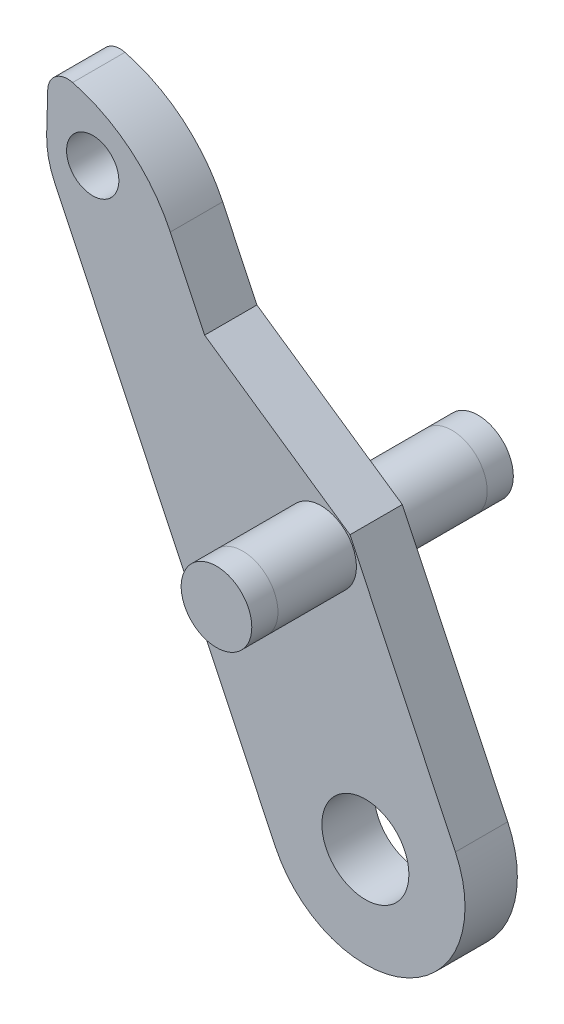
from build123d import *

# Parameters (mm, degrees)
SKETCH1_R           = 1.6637
BASE_EXTRUDE_DEPTH  = 1
SKETCH3_R           = 1
CUT_EXTRUDE1_DEPTH  = 115.651729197
EXTRUDE1_DEPTH      = 5
EXTRUDE1_DEPTH_BACK = 5
SKETCH8_R           = 1.35


with BuildPart() as part:
    # Sketch1 → Base-Extrude (new, symmetric)
    with BuildSketch(Plane.XY):
        with BuildLine():
            Line((91.808429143, 36.130133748), (100.247397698, 18.357709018))
            ThreePointArc((100.247397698, 18.357709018), (105.323348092, 16.550244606), (107.130812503, 21.626195))
            Line((107.130812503, 21.626195), (103.099679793, 30.115739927))
            Line((103.099679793, 30.115739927), (97.542193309, 33.943995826))
            Line((97.542193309, 33.943995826), (96.231163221, 36.705018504))
            ThreePointArc((96.231163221, 36.705018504), (94.706418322, 38.661319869), (92.496466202, 39.78740764))
            ThreePointArc((92.496466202, 39.78740764), (91.847864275, 39.658407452), (91.544381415, 39.070850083))
            Line((91.544381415, 39.070850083), (91.502756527, 37.580653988))
            ThreePointArc((91.502756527, 37.580653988), (91.569752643, 36.837304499), (91.808429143, 36.130133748))
        make_face()
        with Locations((103.689105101, 19.991952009)):
            Circle(SKETCH1_R, mode=Mode.SUBTRACT)
    extrude(amount=BASE_EXTRUDE_DEPTH, both=True)

    # Sketch3 → Cut-Extrude1 (cut, through all)
    with BuildSketch(Plane.XY.offset(1)):
        with Locations((93.263791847, 37.421098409)):
            Circle(SKETCH3_R)
    extrude(amount=-CUT_EXTRUDE1_DEPTH, mode=Mode.SUBTRACT)

    # Sketch8 → Extrude1 (add, two sides: drawn at the far end of the back side and taken through both)
    with BuildSketch(Plane.XY.offset(-EXTRUDE1_DEPTH_BACK)):
        with Locations((101.996136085, 29.175900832)):
            Circle(SKETCH8_R)
    extrude(amount=EXTRUDE1_DEPTH + EXTRUDE1_DEPTH_BACK)


solid = part.part
